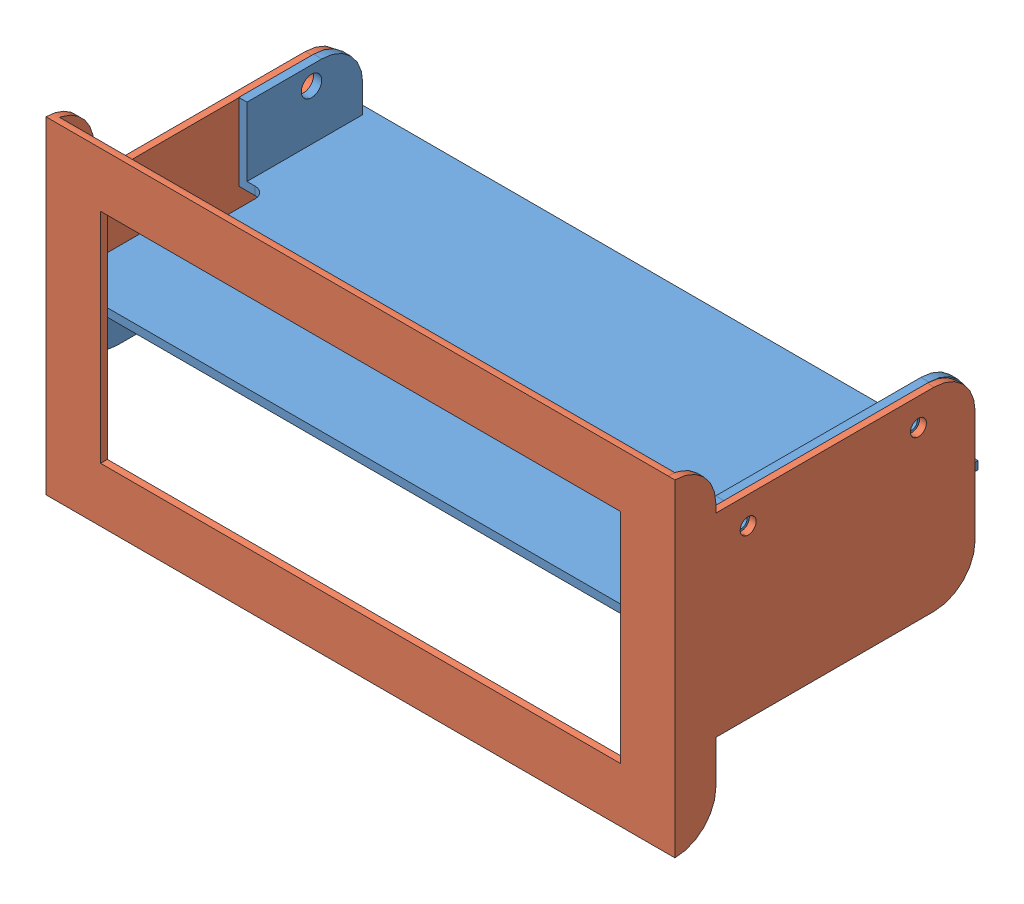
SolidWorks assembly BracketAssy.SLDASM, configuration Default (file format 5000). Lengths in mm.
Overall size (146.38 76.2 72.12).
2 component instances, 2 part files, 3 mates.
Components (placement in the parent):
- BenthosBracket-1: BenthosBracket.SLDPRT [Default] at (-59.046 15.3509 15.702) size (143.21 39.4 70.54)
- Bracket2-1: Bracket2.SLDPRT [Default] at (85.7467 50.1997 17.2895) x (0 -1 0) z (1 0 0) size (76.2 69.85 146.38)
Mates (geometry in assembly coordinates):
- Coincident3: coincident anti-aligned: plane of BenthosBracket-1 through (-59.046 17.2559 15.702) normal (0 0 1); plane of Bracket2-1 through (84.1592 -26.0003 15.702) normal (0 0 -1)
- Coincident4: coincident anti-aligned: plane of BenthosBracket-1 through (84.1592 17.2559 15.702) normal (1 0 0); plane of Bracket2-1 through (84.1592 -26.0003 -52.5605) normal (-1 0 0)
- Concentric2: concentric anti-aligned: circle of BenthosBracket-1; circle of Bracket2-1
